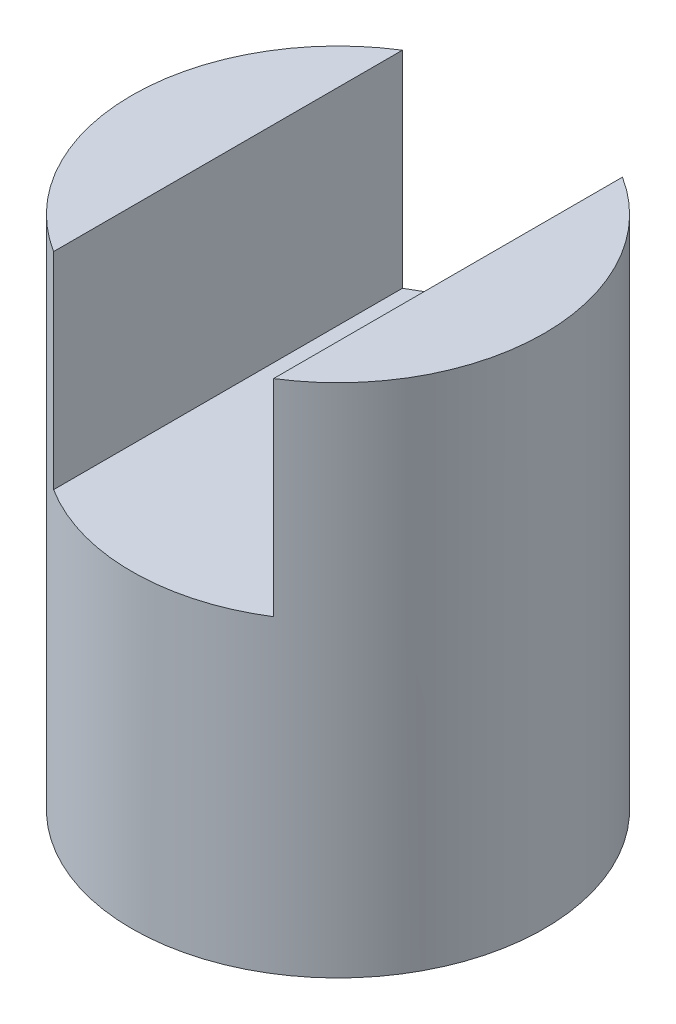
from build123d import *

# Parameters (mm, degrees)
SKETCH_1_R          = 30
EXTRUDE_1_DEPTH     = 75
SKETCH_3_W          = 32
SKETCH_3_H          = 99.473914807
CUT_EXTRUDE_2_DEPTH = 30


with BuildPart() as part:
    # Sketch 1 → Extrude 1 (new body)
    with BuildSketch(Plane(origin=(0, 0, 0), x_dir=(1, 0, 0), z_dir=(0, 1, 0))):
        with Locations(Location((0, 0, 0), (0, 0, 270))):
            Circle(SKETCH_1_R)
    extrude(amount=EXTRUDE_1_DEPTH)

    # Sketch 3 → Cut-Extrude 2 (cut)
    with BuildSketch(Plane(origin=(0, 75, 0), x_dir=(1, 0, 0), z_dir=(0, 1, 0))):
        with Locations((0, -2.441866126)):
            Rectangle(SKETCH_3_W, SKETCH_3_H)
    extrude(amount=-CUT_EXTRUDE_2_DEPTH, mode=Mode.SUBTRACT)


solid = part.part
